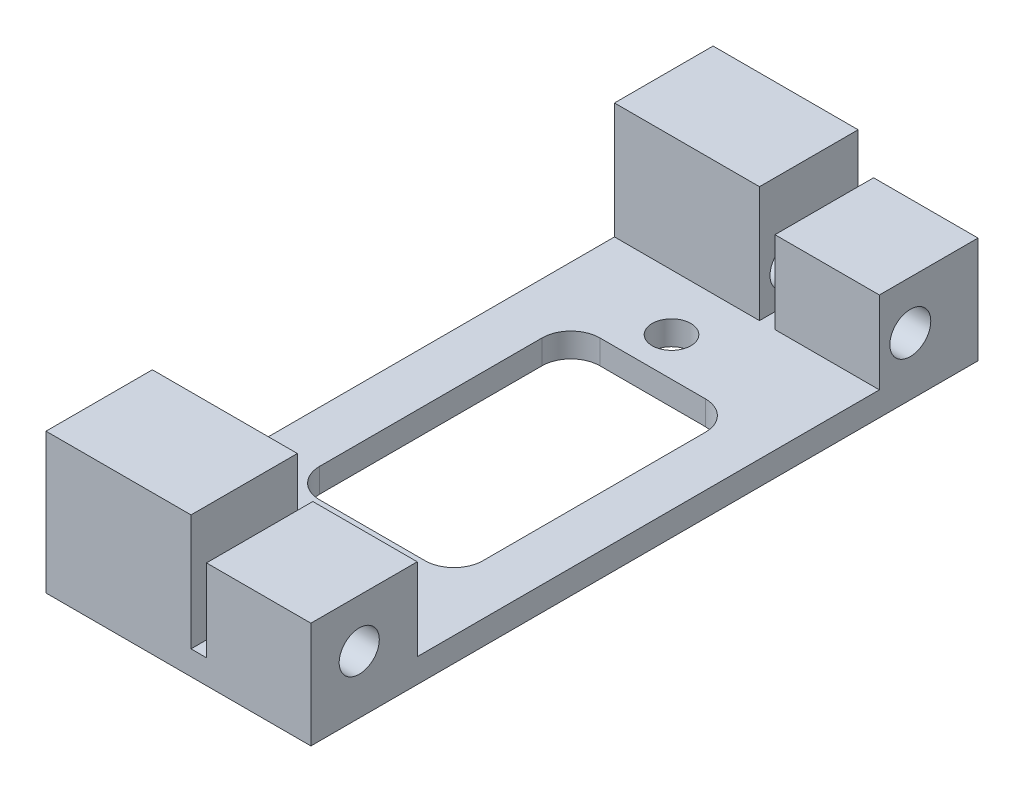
from build123d import *

# Parameters (mm, degrees)
SKETCH1_W           = 27.4
SKETCH1_H           = 69
SKETCH1_R           = 2
BOSS_EXTRUDE1_DEPTH = 2.5
SKETCH2_W           = 15
SKETCH2_H           = 10.2
SKETCH2_H_2         = 11
BOSS_EXTRUDE2_DEPTH = 11
SKETCH2_2_W         = 15
SKETCH2_2_H         = 10.2
SKETCH2_2_H_2       = 11
BOSS_EXTRUDE3_DEPTH = 12
SKETCH4_W           = 10.8
SKETCH4_H           = 10.2
SKETCH4_H_2         = 11
BOSS_EXTRUDE4_DEPTH = 8.5
SKETCH5_R           = 2.074357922
SKETCH5_R_2         = 2.11605773
CUT_EXTRUDE1_DEPTH  = 40


with BuildPart() as part:
    # Sketch1 → Boss-Extrude1 (new body)
    with BuildSketch(Plane(origin=(0, 0, 0), x_dir=(1, 0, 0), z_dir=(0, 1, 0))):
        with Locations((6.2, 1)):
            Rectangle(SKETCH1_W, SKETCH1_H)
        with Locations(Location((4.2, -17.5, 0), (0, 0, 270))):
            Circle(SKETCH1_R, mode=Mode.SUBTRACT)
        with Locations(Location((4.2, 19.5, 0), (0, 0, 270))):
            Circle(SKETCH1_R, mode=Mode.SUBTRACT)
        with BuildLine():
            Line((0.8, 15.5), (11.7, 15.5))
            ThreePointArc((11.7, 15.5), (13.821320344, 14.621320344), (14.7, 12.5))
            Line((14.7, 12.5), (14.7, -10.5))
            ThreePointArc((14.7, -10.5), (13.821320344, -12.621320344), (11.7, -13.5))
            Line((11.7, -13.5), (0.8, -13.5))
            ThreePointArc((0.8, -13.5), (-1.321320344, -12.621320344), (-2.2, -10.5))
            Line((-2.2, -10.5), (-2.2, 12.5))
            ThreePointArc((-2.2, 12.5), (-1.321320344, 14.621320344), (0.8, 15.5))
        make_face(mode=Mode.SUBTRACT)
    extrude(amount=-BOSS_EXTRUDE1_DEPTH)

    # Sketch2 → Boss-Extrude2 (add)
    with BuildSketch(Plane(origin=(0, 0, 0), x_dir=(1, 0, 0), z_dir=(0, 1, 0))):
        with Locations((0, 30.4)):
            Rectangle(SKETCH2_W, SKETCH2_H)
        with Locations((0, -28)):
            Rectangle(SKETCH2_W, SKETCH2_H_2)
    extrude(amount=BOSS_EXTRUDE2_DEPTH)

    # Sketch2_2 → Boss-Extrude3 (add)
    with BuildSketch(Plane(origin=(0, 0, 0), x_dir=(1, 0, 0), z_dir=(0, 1, 0))):
        with Locations((0, 30.4)):
            Rectangle(SKETCH2_2_W, SKETCH2_2_H)
        with Locations((0, -28)):
            Rectangle(SKETCH2_2_W, SKETCH2_2_H_2)
    extrude(amount=BOSS_EXTRUDE3_DEPTH)

    # Sketch4 → Boss-Extrude4 (add)
    with BuildSketch(Plane(origin=(0, 0, 0), x_dir=(1, 0, 0), z_dir=(0, 1, 0))):
        with Locations((14.5, 30.4)):
            Rectangle(SKETCH4_W, SKETCH4_H)
        with Locations((14.5, -28)):
            Rectangle(SKETCH4_W, SKETCH4_H_2)
    extrude(amount=BOSS_EXTRUDE4_DEPTH)

    # Sketch5 → Cut-Extrude1 (cut)
    with BuildSketch(Plane(origin=(19.9, 0, 0), x_dir=(0, 0, -1), z_dir=(1, 0, 0))):
        with Locations((-28.5, 3.5)):
            Circle(SKETCH5_R)
        with Locations((28.5, 3.5)):
            Circle(SKETCH5_R_2)
    extrude(amount=-CUT_EXTRUDE1_DEPTH, mode=Mode.SUBTRACT)


solid = part.part
